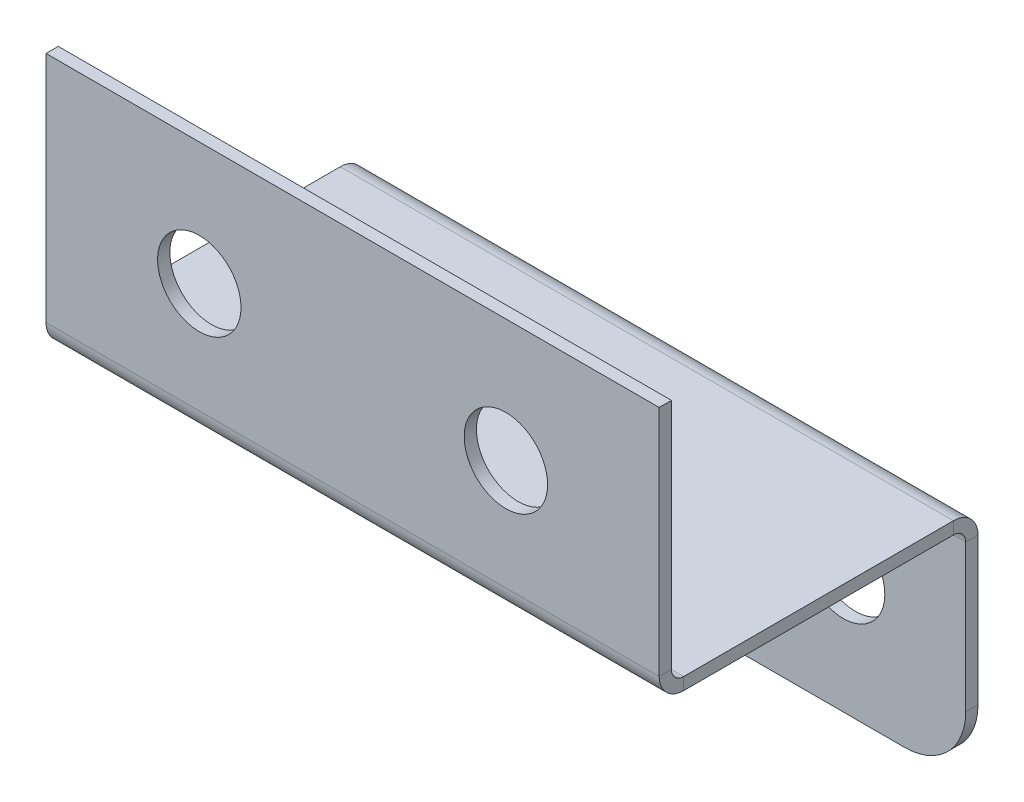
ISO-10303-21;
HEADER;
FILE_DESCRIPTION(('STEP AP214'),'2;1');
FILE_NAME('part.step','',(''),(''),'','','');
FILE_SCHEMA(('AUTOMOTIVE_DESIGN { 1 0 10303 214 1 1 1 1 }'));
ENDSEC;
DATA;
#1=APPLICATION_CONTEXT('core data for automotive mechanical design processes');
#2=APPLICATION_PROTOCOL_DEFINITION('international standard','automotive_design',2000,#1);
#3=PRODUCT_CONTEXT('',#1,'mechanical');
#4=PRODUCT('Part','Part','',(#3));
#5=PRODUCT_RELATED_PRODUCT_CATEGORY('part','',(#4));
#6=PRODUCT_DEFINITION_FORMATION('','',#4);
#7=PRODUCT_DEFINITION_CONTEXT('part definition',#1,'design');
#8=PRODUCT_DEFINITION('design','',#6,#7);
#9=PRODUCT_DEFINITION_SHAPE('','',#8);
#10=(LENGTH_UNIT() NAMED_UNIT(*) SI_UNIT(.MILLI.,.METRE.));
#11=(NAMED_UNIT(*) PLANE_ANGLE_UNIT() SI_UNIT($,.RADIAN.));
#12=(NAMED_UNIT(*) SI_UNIT($,.STERADIAN.) SOLID_ANGLE_UNIT());
#13=UNCERTAINTY_MEASURE_WITH_UNIT(LENGTH_MEASURE(1.E-05),#10,'distance_accuracy_value','');
#14=(GEOMETRIC_REPRESENTATION_CONTEXT(3) GLOBAL_UNCERTAINTY_ASSIGNED_CONTEXT((#13)) GLOBAL_UNIT_ASSIGNED_CONTEXT((#10,
#11,#12)) REPRESENTATION_CONTEXT('',''));
#15=CARTESIAN_POINT('',(0.,0.,0.));
#16=DIRECTION('',(0.,0.,1.));
#17=DIRECTION('',(1.,0.,0.));
#18=AXIS2_PLACEMENT_3D('',#15,#16,#17);
#19=CARTESIAN_POINT('',(25.,-20.,-1.));
#20=DIRECTION('',(1.,0.,0.));
#21=DIRECTION('',(0.,0.,-0.999999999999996));
#22=AXIS2_PLACEMENT_3D('',#19,#20,#21);
#23=PLANE('',#22);
#24=DIRECTION('',(0.,-1.,0.));
#25=VECTOR('',#24,1.);
#26=CARTESIAN_POINT('',(25.,-20.,-1.));
#27=LINE('',#26,#25);
#28=CARTESIAN_POINT('',(25.,-20.,-1.));
#29=VERTEX_POINT('',#28);
#30=CARTESIAN_POINT('',(25.,-21.,-1.));
#31=VERTEX_POINT('',#30);
#32=EDGE_CURVE('E325',#29,#31,#27,.T.);
#33=ORIENTED_EDGE('',*,*,#32,.F.);
#34=CARTESIAN_POINT('',(25.,-19.,-1.));
#35=DIRECTION('',(-1.,0.,0.));
#36=DIRECTION('',(0.,0.,0.999999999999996));
#37=AXIS2_PLACEMENT_3D('',#34,#35,#36);
#38=CIRCLE('',#37,1.);
#39=CARTESIAN_POINT('',(25.,-19.,0.));
#40=VERTEX_POINT('',#39);
#41=EDGE_CURVE('E245',#40,#29,#38,.F.);
#42=ORIENTED_EDGE('',*,*,#41,.F.);
#43=DIRECTION('',(0.,0.,-0.999999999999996));
#44=VECTOR('',#43,1.);
#45=CARTESIAN_POINT('',(25.,-18.9999999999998,1.));
#46=LINE('',#45,#44);
#47=CARTESIAN_POINT('',(25.,-18.9999999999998,1.));
#48=VERTEX_POINT('',#47);
#49=EDGE_CURVE('E322',#48,#40,#46,.T.);
#50=ORIENTED_EDGE('',*,*,#49,.F.);
#51=CARTESIAN_POINT('',(25.,-19.,-1.));
#52=DIRECTION('',(1.,0.,0.));
#53=DIRECTION('',(0.,0.,-0.999999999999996));
#54=AXIS2_PLACEMENT_3D('',#51,#52,#53);
#55=CIRCLE('',#54,2.);
#56=EDGE_CURVE('E261',#48,#31,#55,.T.);
#57=ORIENTED_EDGE('',*,*,#56,.T.);
#58=EDGE_LOOP('',(#33,#42,#50,#57));
#59=FACE_BOUND('',#58,.T.);
#60=ADVANCED_FACE('F56',(#59),#23,.T.);
#61=CARTESIAN_POINT('',(25.,-18.9999999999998,1.));
#62=DIRECTION('',(1.,0.,0.));
#63=DIRECTION('',(0.,0.,-0.999999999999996));
#64=AXIS2_PLACEMENT_3D('',#61,#62,#63);
#65=PLANE('',#64);
#66=DIRECTION('',(0.,0.,-0.999999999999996));
#67=VECTOR('',#66,1.);
#68=CARTESIAN_POINT('',(25.,-20.,0.));
#69=LINE('',#68,#67);
#70=CARTESIAN_POINT('',(25.,-19.9999999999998,-23.));
#71=VERTEX_POINT('',#70);
#72=EDGE_CURVE('E241',#29,#71,#69,.T.);
#73=ORIENTED_EDGE('',*,*,#72,.F.);
#74=ORIENTED_EDGE('',*,*,#32,.T.);
#75=DIRECTION('',(0.,0.,-0.999999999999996));
#76=VECTOR('',#75,1.);
#77=CARTESIAN_POINT('',(25.,-21.,0.));
#78=LINE('',#77,#76);
#79=CARTESIAN_POINT('',(25.,-20.9999999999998,-23.));
#80=VERTEX_POINT('',#79);
#81=EDGE_CURVE('E265',#31,#80,#78,.T.);
#82=ORIENTED_EDGE('',*,*,#81,.T.);
#83=DIRECTION('',(0.,1.,0.));
#84=VECTOR('',#83,1.);
#85=CARTESIAN_POINT('',(25.,-20.9999999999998,-23.));
#86=LINE('',#85,#84);
#87=EDGE_CURVE('E310',#80,#71,#86,.T.);
#88=ORIENTED_EDGE('',*,*,#87,.T.);
#89=EDGE_LOOP('',(#73,#74,#82,#88));
#90=FACE_BOUND('',#89,.T.);
#91=ADVANCED_FACE('F444',(#90),#65,.T.);
#92=CARTESIAN_POINT('',(-25.,-19.0000000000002,0.));
#93=DIRECTION('',(-1.,0.,0.));
#94=DIRECTION('',(0.,0.,0.999999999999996));
#95=AXIS2_PLACEMENT_3D('',#92,#93,#94);
#96=PLANE('',#95);
#97=DIRECTION('',(0.,0.,0.999999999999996));
#98=VECTOR('',#97,1.);
#99=CARTESIAN_POINT('',(-25.,-19.0000000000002,0.));
#100=LINE('',#99,#98);
#101=CARTESIAN_POINT('',(-25.,-19.0000000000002,0.));
#102=VERTEX_POINT('',#101);
#103=CARTESIAN_POINT('',(-25.,-19.,1.));
#104=VERTEX_POINT('',#103);
#105=EDGE_CURVE('E319',#102,#104,#100,.T.);
#106=ORIENTED_EDGE('',*,*,#105,.F.);
#107=CARTESIAN_POINT('',(-25.,-19.0000000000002,-1.));
#108=DIRECTION('',(-1.,0.,0.));
#109=DIRECTION('',(0.,0.,0.999999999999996));
#110=AXIS2_PLACEMENT_3D('',#107,#108,#109);
#111=CIRCLE('',#110,1.);
#112=CARTESIAN_POINT('',(-25.,-20.0000000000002,-1.));
#113=VERTEX_POINT('',#112);
#114=EDGE_CURVE('E204',#102,#113,#111,.F.);
#115=ORIENTED_EDGE('',*,*,#114,.T.);
#116=DIRECTION('',(0.,1.,0.));
#117=VECTOR('',#116,1.);
#118=CARTESIAN_POINT('',(-25.,-21.0000000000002,-1.));
#119=LINE('',#118,#117);
#120=CARTESIAN_POINT('',(-25.,-21.0000000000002,-1.));
#121=VERTEX_POINT('',#120);
#122=EDGE_CURVE('E316',#121,#113,#119,.T.);
#123=ORIENTED_EDGE('',*,*,#122,.F.);
#124=CARTESIAN_POINT('',(-25.,-19.0000000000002,-1.));
#125=DIRECTION('',(1.,0.,0.));
#126=DIRECTION('',(0.,0.,-0.999999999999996));
#127=AXIS2_PLACEMENT_3D('',#124,#125,#126);
#128=CIRCLE('',#127,2.);
#129=EDGE_CURVE('E223',#104,#121,#128,.T.);
#130=ORIENTED_EDGE('',*,*,#129,.F.);
#131=EDGE_LOOP('',(#106,#115,#123,#130));
#132=FACE_BOUND('',#131,.T.);
#133=ADVANCED_FACE('F402',(#132),#96,.T.);
#134=CARTESIAN_POINT('',(-25.,-21.0000000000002,-1.));
#135=DIRECTION('',(-1.,0.,0.));
#136=DIRECTION('',(0.,0.,0.999999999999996));
#137=AXIS2_PLACEMENT_3D('',#134,#135,#136);
#138=PLANE('',#137);
#139=DIRECTION('',(0.,-1.,0.));
#140=VECTOR('',#139,1.);
#141=CARTESIAN_POINT('',(-25.,0.,0.));
#142=LINE('',#141,#140);
#143=CARTESIAN_POINT('',(-25.,0.,0.));
#144=VERTEX_POINT('',#143);
#145=EDGE_CURVE('E211',#144,#102,#142,.T.);
#146=ORIENTED_EDGE('',*,*,#145,.T.);
#147=ORIENTED_EDGE('',*,*,#105,.T.);
#148=DIRECTION('',(0.,-1.,0.));
#149=VECTOR('',#148,1.);
#150=CARTESIAN_POINT('',(-25.,0.,1.));
#151=LINE('',#150,#149);
#152=CARTESIAN_POINT('',(-25.,0.,1.));
#153=VERTEX_POINT('',#152);
#154=EDGE_CURVE('E219',#153,#104,#151,.T.);
#155=ORIENTED_EDGE('',*,*,#154,.F.);
#156=DIRECTION('',(0.,0.,-0.999999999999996));
#157=VECTOR('',#156,1.);
#158=CARTESIAN_POINT('',(-25.,0.,1.));
#159=LINE('',#158,#157);
#160=EDGE_CURVE('E215',#153,#144,#159,.T.);
#161=ORIENTED_EDGE('',*,*,#160,.T.);
#162=EDGE_LOOP('',(#146,#147,#155,#161));
#163=FACE_BOUND('',#162,.T.);
#164=ADVANCED_FACE('F499',(#163),#138,.T.);
#165=CARTESIAN_POINT('',(25.,-22.,-25.));
#166=DIRECTION('',(1.,0.,0.));
#167=DIRECTION('',(0.,0.,-0.999999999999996));
#168=AXIS2_PLACEMENT_3D('',#165,#166,#167);
#169=PLANE('',#168);
#170=DIRECTION('',(0.,0.,0.999999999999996));
#171=VECTOR('',#170,1.);
#172=CARTESIAN_POINT('',(25.,-22.,-25.));
#173=LINE('',#172,#171);
#174=CARTESIAN_POINT('',(25.,-22.,-25.));
#175=VERTEX_POINT('',#174);
#176=CARTESIAN_POINT('',(25.,-22.,-24.));
#177=VERTEX_POINT('',#176);
#178=EDGE_CURVE('E313',#175,#177,#173,.T.);
#179=ORIENTED_EDGE('',*,*,#178,.F.);
#180=CARTESIAN_POINT('',(25.,-21.9999999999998,-23.));
#181=DIRECTION('',(1.,0.,0.));
#182=DIRECTION('',(0.,0.,-0.999999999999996));
#183=AXIS2_PLACEMENT_3D('',#180,#181,#182);
#184=CIRCLE('',#183,2.);
#185=EDGE_CURVE('E186',#71,#175,#184,.F.);
#186=ORIENTED_EDGE('',*,*,#185,.F.);
#187=ORIENTED_EDGE('',*,*,#87,.F.);
#188=CARTESIAN_POINT('',(25.,-21.9999999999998,-23.));
#189=DIRECTION('',(1.,0.,0.));
#190=DIRECTION('',(0.,0.,-0.999999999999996));
#191=AXIS2_PLACEMENT_3D('',#188,#189,#190);
#192=CIRCLE('',#191,1.);
#193=EDGE_CURVE('E269',#80,#177,#192,.F.);
#194=ORIENTED_EDGE('',*,*,#193,.T.);
#195=EDGE_LOOP('',(#179,#186,#187,#194));
#196=FACE_BOUND('',#195,.T.);
#197=ADVANCED_FACE('F417',(#196),#169,.T.);
#198=CARTESIAN_POINT('',(25.,-20.9999999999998,-23.));
#199=DIRECTION('',(1.,0.,0.));
#200=DIRECTION('',(0.,0.,-0.999999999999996));
#201=AXIS2_PLACEMENT_3D('',#198,#199,#200);
#202=PLANE('',#201);
#203=DIRECTION('',(0.,-1.,0.));
#204=VECTOR('',#203,1.);
#205=CARTESIAN_POINT('',(25.,-20.,-24.));
#206=LINE('',#205,#204);
#207=CARTESIAN_POINT('',(24.9999999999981,-34.,-24.));
#208=VERTEX_POINT('',#207);
#209=EDGE_CURVE('E234',#177,#208,#206,.T.);
#210=ORIENTED_EDGE('',*,*,#209,.T.);
#211=DIRECTION('',(0.,0.,0.999999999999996));
#212=VECTOR('',#211,1.);
#213=CARTESIAN_POINT('',(24.9999999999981,-34.,-23.));
#214=LINE('',#213,#212);
#215=CARTESIAN_POINT('',(24.9999999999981,-34.,-25.));
#216=VERTEX_POINT('',#215);
#217=EDGE_CURVE('E11',#208,#216,#214,.F.);
#218=ORIENTED_EDGE('',*,*,#217,.T.);
#219=DIRECTION('',(0.,-1.,0.));
#220=VECTOR('',#219,1.);
#221=CARTESIAN_POINT('',(25.,-20.,-25.));
#222=LINE('',#221,#220);
#223=EDGE_CURVE('E236',#175,#216,#222,.T.);
#224=ORIENTED_EDGE('',*,*,#223,.F.);
#225=ORIENTED_EDGE('',*,*,#178,.T.);
#226=EDGE_LOOP('',(#210,#218,#224,#225));
#227=FACE_BOUND('',#226,.T.);
#228=ADVANCED_FACE('F420',(#227),#202,.T.);
#229=CARTESIAN_POINT('',(-25.,-20.,-23.));
#230=DIRECTION('',(-1.,0.,0.));
#231=DIRECTION('',(0.,0.,0.999999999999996));
#232=AXIS2_PLACEMENT_3D('',#229,#230,#231);
#233=PLANE('',#232);
#234=DIRECTION('',(0.,-1.,0.));
#235=VECTOR('',#234,1.);
#236=CARTESIAN_POINT('',(-25.,-20.,-23.));
#237=LINE('',#236,#235);
#238=CARTESIAN_POINT('',(-25.,-20.,-23.));
#239=VERTEX_POINT('',#238);
#240=CARTESIAN_POINT('',(-25.,-21.,-23.));
#241=VERTEX_POINT('',#240);
#242=EDGE_CURVE('E173',#239,#241,#237,.T.);
#243=ORIENTED_EDGE('',*,*,#242,.F.);
#244=CARTESIAN_POINT('',(-25.,-22.,-23.));
#245=DIRECTION('',(1.,0.,0.));
#246=DIRECTION('',(0.,0.,-0.999999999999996));
#247=AXIS2_PLACEMENT_3D('',#244,#245,#246);
#248=CIRCLE('',#247,2.);
#249=CARTESIAN_POINT('',(-25.,-22.0000000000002,-25.));
#250=VERTEX_POINT('',#249);
#251=EDGE_CURVE('E183',#239,#250,#248,.F.);
#252=ORIENTED_EDGE('',*,*,#251,.T.);
#253=DIRECTION('',(0.,0.,-0.999999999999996));
#254=VECTOR('',#253,1.);
#255=CARTESIAN_POINT('',(-25.,-22.0000000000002,-24.));
#256=LINE('',#255,#254);
#257=CARTESIAN_POINT('',(-25.,-22.0000000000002,-24.));
#258=VERTEX_POINT('',#257);
#259=EDGE_CURVE('E159',#258,#250,#256,.T.);
#260=ORIENTED_EDGE('',*,*,#259,.F.);
#261=CARTESIAN_POINT('',(-25.,-22.,-23.));
#262=DIRECTION('',(1.,0.,0.));
#263=DIRECTION('',(0.,0.,-0.999999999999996));
#264=AXIS2_PLACEMENT_3D('',#261,#262,#263);
#265=CIRCLE('',#264,1.);
#266=EDGE_CURVE('E231',#241,#258,#265,.F.);
#267=ORIENTED_EDGE('',*,*,#266,.F.);
#268=EDGE_LOOP('',(#243,#252,#260,#267));
#269=FACE_BOUND('',#268,.T.);
#270=ADVANCED_FACE('F196',(#269),#233,.T.);
#271=CARTESIAN_POINT('',(-25.,-22.0000000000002,-24.));
#272=DIRECTION('',(-1.,0.,0.));
#273=DIRECTION('',(0.,0.,0.999999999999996));
#274=AXIS2_PLACEMENT_3D('',#271,#272,#273);
#275=PLANE('',#274);
#276=DIRECTION('',(0.,0.,-0.999999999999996));
#277=VECTOR('',#276,1.);
#278=CARTESIAN_POINT('',(-25.,-20.0000000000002,0.));
#279=LINE('',#278,#277);
#280=EDGE_CURVE('E199',#113,#239,#279,.T.);
#281=ORIENTED_EDGE('',*,*,#280,.T.);
#282=ORIENTED_EDGE('',*,*,#242,.T.);
#283=DIRECTION('',(0.,0.,-0.999999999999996));
#284=VECTOR('',#283,1.);
#285=CARTESIAN_POINT('',(-25.,-21.0000000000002,0.));
#286=LINE('',#285,#284);
#287=EDGE_CURVE('E227',#121,#241,#286,.T.);
#288=ORIENTED_EDGE('',*,*,#287,.F.);
#289=ORIENTED_EDGE('',*,*,#122,.T.);
#290=EDGE_LOOP('',(#281,#282,#288,#289));
#291=FACE_BOUND('',#290,.T.);
#292=ADVANCED_FACE('F406',(#291),#275,.T.);
#293=CARTESIAN_POINT('',(25.,-20.,-24.));
#294=DIRECTION('',(0.,0.,-0.999999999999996));
#295=DIRECTION('',(0.,1.,0.));
#296=AXIS2_PLACEMENT_3D('',#293,#294,#295);
#297=PLANE('',#296);
#298=CARTESIAN_POINT('',(-15.,-29.,-24.));
#299=DIRECTION('',(0.,0.,0.999999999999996));
#300=DIRECTION('',(1.,0.,0.));
#301=AXIS2_PLACEMENT_3D('',#298,#299,#300);
#302=CIRCLE('',#301,3.4);
#303=CARTESIAN_POINT('',(-11.6,-29.,-24.));
#304=VERTEX_POINT('',#303);
#305=EDGE_CURVE('E352',#304,#304,#302,.T.);
#306=ORIENTED_EDGE('',*,*,#305,.F.);
#307=EDGE_LOOP('',(#306));
#308=FACE_BOUND('',#307,.T.);
#309=CARTESIAN_POINT('',(15.,-29.,-24.));
#310=DIRECTION('',(0.,0.,0.999999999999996));
#311=DIRECTION('',(1.,0.,0.));
#312=AXIS2_PLACEMENT_3D('',#309,#310,#311);
#313=CIRCLE('',#312,3.4);
#314=CARTESIAN_POINT('',(18.4,-29.,-24.));
#315=VERTEX_POINT('',#314);
#316=EDGE_CURVE('E351',#315,#315,#313,.T.);
#317=ORIENTED_EDGE('',*,*,#316,.F.);
#318=EDGE_LOOP('',(#317));
#319=FACE_BOUND('',#318,.T.);
#320=DIRECTION('',(0.,-1.,0.));
#321=VECTOR('',#320,1.);
#322=CARTESIAN_POINT('',(-25.,-20.0000000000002,-24.));
#323=LINE('',#322,#321);
#324=CARTESIAN_POINT('',(-25.0000000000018,-34.0000000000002,-24.));
#325=VERTEX_POINT('',#324);
#326=EDGE_CURVE('E167',#258,#325,#323,.T.);
#327=ORIENTED_EDGE('',*,*,#326,.T.);
#328=CARTESIAN_POINT('',(-20.0000000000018,-34.,-24.));
#329=DIRECTION('',(0.,0.,-0.999999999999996));
#330=DIRECTION('',(0.,1.,0.));
#331=AXIS2_PLACEMENT_3D('',#328,#329,#330);
#332=CIRCLE('',#331,5.);
#333=CARTESIAN_POINT('',(-20.,-39.,-24.));
#334=VERTEX_POINT('',#333);
#335=EDGE_CURVE('E334',#325,#334,#332,.F.);
#336=ORIENTED_EDGE('',*,*,#335,.T.);
#337=DIRECTION('',(-1.,0.,0.));
#338=VECTOR('',#337,1.);
#339=CARTESIAN_POINT('',(24.9999999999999,-39.,-24.));
#340=LINE('',#339,#338);
#341=CARTESIAN_POINT('',(20.,-39.0000000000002,-24.));
#342=VERTEX_POINT('',#341);
#343=EDGE_CURVE('E174',#342,#334,#340,.T.);
#344=ORIENTED_EDGE('',*,*,#343,.F.);
#345=CARTESIAN_POINT('',(19.9999999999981,-34.0000000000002,-24.));
#346=DIRECTION('',(0.,0.,-0.999999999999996));
#347=DIRECTION('',(0.,1.,0.));
#348=AXIS2_PLACEMENT_3D('',#345,#346,#347);
#349=CIRCLE('',#348,5.);
#350=EDGE_CURVE('E331',#342,#208,#349,.F.);
#351=ORIENTED_EDGE('',*,*,#350,.T.);
#352=ORIENTED_EDGE('',*,*,#209,.F.);
#353=DIRECTION('',(-1.,0.,0.));
#354=VECTOR('',#353,1.);
#355=CARTESIAN_POINT('',(25.,-22.,-24.));
#356=LINE('',#355,#354);
#357=EDGE_CURVE('E273',#177,#258,#356,.T.);
#358=ORIENTED_EDGE('',*,*,#357,.T.);
#359=EDGE_LOOP('',(#327,#336,#344,#351,#352,#358));
#360=FACE_BOUND('',#359,.T.);
#361=ADVANCED_FACE('F429',(#308,#319,#360),#297,.F.);
#362=CARTESIAN_POINT('',(24.9999999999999,-39.,-25.));
#363=DIRECTION('',(0.,-1.,0.));
#364=DIRECTION('',(0.,0.,-0.999999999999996));
#365=AXIS2_PLACEMENT_3D('',#362,#363,#364);
#366=PLANE('',#365);
#367=ORIENTED_EDGE('',*,*,#343,.T.);
#368=DIRECTION('',(0.,0.,0.999999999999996));
#369=VECTOR('',#368,1.);
#370=CARTESIAN_POINT('',(-20.,-39.,-25.));
#371=LINE('',#370,#369);
#372=CARTESIAN_POINT('',(-20.,-39.,-25.));
#373=VERTEX_POINT('',#372);
#374=EDGE_CURVE('E77',#334,#373,#371,.F.);
#375=ORIENTED_EDGE('',*,*,#374,.T.);
#376=DIRECTION('',(-1.,0.,0.));
#377=VECTOR('',#376,1.);
#378=CARTESIAN_POINT('',(24.9999999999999,-39.,-25.));
#379=LINE('',#378,#377);
#380=CARTESIAN_POINT('',(20.,-39.0000000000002,-25.));
#381=VERTEX_POINT('',#380);
#382=EDGE_CURVE('E189',#381,#373,#379,.T.);
#383=ORIENTED_EDGE('',*,*,#382,.F.);
#384=DIRECTION('',(0.,0.,0.999999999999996));
#385=VECTOR('',#384,1.);
#386=CARTESIAN_POINT('',(20.,-39.0000000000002,-25.));
#387=LINE('',#386,#385);
#388=EDGE_CURVE('E337',#381,#342,#387,.T.);
#389=ORIENTED_EDGE('',*,*,#388,.T.);
#390=EDGE_LOOP('',(#367,#375,#383,#389));
#391=FACE_BOUND('',#390,.T.);
#392=ADVANCED_FACE('F427',(#391),#366,.T.);
#393=CARTESIAN_POINT('',(25.,-20.,-25.));
#394=DIRECTION('',(0.,0.,-0.999999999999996));
#395=DIRECTION('',(0.,1.,0.));
#396=AXIS2_PLACEMENT_3D('',#393,#394,#395);
#397=PLANE('',#396);
#398=CARTESIAN_POINT('',(-15.,-29.,-25.));
#399=DIRECTION('',(0.,0.,-0.999999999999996));
#400=DIRECTION('',(0.,1.,0.));
#401=AXIS2_PLACEMENT_3D('',#398,#399,#400);
#402=CIRCLE('',#401,3.4);
#403=CARTESIAN_POINT('',(-11.6,-29.,-25.));
#404=VERTEX_POINT('',#403);
#405=EDGE_CURVE('E365',#404,#404,#402,.F.);
#406=ORIENTED_EDGE('',*,*,#405,.T.);
#407=EDGE_LOOP('',(#406));
#408=FACE_BOUND('',#407,.T.);
#409=CARTESIAN_POINT('',(15.,-29.,-25.));
#410=DIRECTION('',(0.,0.,-0.999999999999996));
#411=DIRECTION('',(0.,1.,0.));
#412=AXIS2_PLACEMENT_3D('',#409,#410,#411);
#413=CIRCLE('',#412,3.4);
#414=CARTESIAN_POINT('',(18.4,-29.,-25.));
#415=VERTEX_POINT('',#414);
#416=EDGE_CURVE('E349',#415,#415,#413,.F.);
#417=ORIENTED_EDGE('',*,*,#416,.T.);
#418=EDGE_LOOP('',(#417));
#419=FACE_BOUND('',#418,.T.);
#420=ORIENTED_EDGE('',*,*,#382,.T.);
#421=CARTESIAN_POINT('',(-20.0000000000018,-34.,-25.));
#422=DIRECTION('',(0.,0.,-0.999999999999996));
#423=DIRECTION('',(0.,1.,0.));
#424=AXIS2_PLACEMENT_3D('',#421,#422,#423);
#425=CIRCLE('',#424,5.);
#426=CARTESIAN_POINT('',(-25.0000000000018,-34.0000000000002,-25.));
#427=VERTEX_POINT('',#426);
#428=EDGE_CURVE('E64',#373,#427,#425,.T.);
#429=ORIENTED_EDGE('',*,*,#428,.T.);
#430=DIRECTION('',(0.,-1.,0.));
#431=VECTOR('',#430,1.);
#432=CARTESIAN_POINT('',(-25.,-20.0000000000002,-25.));
#433=LINE('',#432,#431);
#434=EDGE_CURVE('E164',#250,#427,#433,.T.);
#435=ORIENTED_EDGE('',*,*,#434,.F.);
#436=DIRECTION('',(-1.,0.,0.));
#437=VECTOR('',#436,1.);
#438=CARTESIAN_POINT('',(25.,-22.,-25.));
#439=LINE('',#438,#437);
#440=EDGE_CURVE('E180',#175,#250,#439,.T.);
#441=ORIENTED_EDGE('',*,*,#440,.F.);
#442=ORIENTED_EDGE('',*,*,#223,.T.);
#443=CARTESIAN_POINT('',(19.9999999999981,-34.0000000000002,-25.));
#444=DIRECTION('',(0.,0.,-0.999999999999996));
#445=DIRECTION('',(0.,1.,0.));
#446=AXIS2_PLACEMENT_3D('',#443,#444,#445);
#447=CIRCLE('',#446,5.);
#448=EDGE_CURVE('E343',#216,#381,#447,.T.);
#449=ORIENTED_EDGE('',*,*,#448,.T.);
#450=EDGE_LOOP('',(#420,#429,#435,#441,#442,#449));
#451=FACE_BOUND('',#450,.T.);
#452=ADVANCED_FACE('F192',(#408,#419,#451),#397,.T.);
#453=CARTESIAN_POINT('',(25.,-21.9999999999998,-23.));
#454=DIRECTION('',(-1.,0.,0.));
#455=DIRECTION('',(0.,0.,0.999999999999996));
#456=AXIS2_PLACEMENT_3D('',#453,#454,#455);
#457=CYLINDRICAL_SURFACE('',#456,2.);
#458=ORIENTED_EDGE('',*,*,#251,.F.);
#459=DIRECTION('',(-1.,0.,0.));
#460=VECTOR('',#459,1.);
#461=CARTESIAN_POINT('',(25.,-19.9999999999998,-23.));
#462=LINE('',#461,#460);
#463=EDGE_CURVE('E190',#71,#239,#462,.T.);
#464=ORIENTED_EDGE('',*,*,#463,.F.);
#465=ORIENTED_EDGE('',*,*,#185,.T.);
#466=ORIENTED_EDGE('',*,*,#440,.T.);
#467=EDGE_LOOP('',(#458,#464,#465,#466));
#468=FACE_BOUND('',#467,.T.);
#469=ADVANCED_FACE('F181',(#468),#457,.T.);
#470=CARTESIAN_POINT('',(25.,-20.,0.));
#471=DIRECTION('',(0.,1.,0.));
#472=DIRECTION('',(0.,0.,0.999999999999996));
#473=AXIS2_PLACEMENT_3D('',#470,#471,#472);
#474=PLANE('',#473);
#475=ORIENTED_EDGE('',*,*,#280,.F.);
#476=DIRECTION('',(-1.,0.,0.));
#477=VECTOR('',#476,1.);
#478=CARTESIAN_POINT('',(25.,-20.,-1.));
#479=LINE('',#478,#477);
#480=EDGE_CURVE('E299',#29,#113,#479,.T.);
#481=ORIENTED_EDGE('',*,*,#480,.F.);
#482=ORIENTED_EDGE('',*,*,#72,.T.);
#483=ORIENTED_EDGE('',*,*,#463,.T.);
#484=EDGE_LOOP('',(#475,#481,#482,#483));
#485=FACE_BOUND('',#484,.T.);
#486=ADVANCED_FACE('F415',(#485),#474,.T.);
#487=CARTESIAN_POINT('',(25.,-19.,-1.));
#488=DIRECTION('',(-1.,0.,0.));
#489=DIRECTION('',(0.,0.,0.999999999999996));
#490=AXIS2_PLACEMENT_3D('',#487,#488,#489);
#491=CYLINDRICAL_SURFACE('',#490,1.);
#492=ORIENTED_EDGE('',*,*,#114,.F.);
#493=DIRECTION('',(-1.,0.,0.));
#494=VECTOR('',#493,1.);
#495=CARTESIAN_POINT('',(25.,-19.,0.));
#496=LINE('',#495,#494);
#497=EDGE_CURVE('E295',#40,#102,#496,.T.);
#498=ORIENTED_EDGE('',*,*,#497,.F.);
#499=ORIENTED_EDGE('',*,*,#41,.T.);
#500=ORIENTED_EDGE('',*,*,#480,.T.);
#501=EDGE_LOOP('',(#492,#498,#499,#500));
#502=FACE_BOUND('',#501,.T.);
#503=ADVANCED_FACE('F410',(#502),#491,.F.);
#504=CARTESIAN_POINT('',(25.,0.,0.));
#505=DIRECTION('',(0.,0.,-0.999999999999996));
#506=DIRECTION('',(0.,1.,0.));
#507=AXIS2_PLACEMENT_3D('',#504,#505,#506);
#508=PLANE('',#507);
#509=CARTESIAN_POINT('',(-12.5000000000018,-10.,0.));
#510=DIRECTION('',(0.,0.,-0.999999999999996));
#511=DIRECTION('',(0.,1.,0.));
#512=AXIS2_PLACEMENT_3D('',#509,#510,#511);
#513=CIRCLE('',#512,3.4);
#514=CARTESIAN_POINT('',(-9.10000000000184,-10.0000000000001,0.));
#515=VERTEX_POINT('',#514);
#516=EDGE_CURVE('E359',#515,#515,#513,.F.);
#517=ORIENTED_EDGE('',*,*,#516,.T.);
#518=EDGE_LOOP('',(#517));
#519=FACE_BOUND('',#518,.T.);
#520=CARTESIAN_POINT('',(12.4999999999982,-9.99999999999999,0.));
#521=DIRECTION('',(0.,0.,-0.999999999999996));
#522=DIRECTION('',(0.,1.,0.));
#523=AXIS2_PLACEMENT_3D('',#520,#521,#522);
#524=CIRCLE('',#523,3.4);
#525=CARTESIAN_POINT('',(15.8999999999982,-10.,0.));
#526=VERTEX_POINT('',#525);
#527=EDGE_CURVE('E358',#526,#526,#524,.F.);
#528=ORIENTED_EDGE('',*,*,#527,.T.);
#529=EDGE_LOOP('',(#528));
#530=FACE_BOUND('',#529,.T.);
#531=ORIENTED_EDGE('',*,*,#145,.F.);
#532=DIRECTION('',(-1.,0.,0.));
#533=VECTOR('',#532,1.);
#534=CARTESIAN_POINT('',(25.,0.,0.));
#535=LINE('',#534,#533);
#536=CARTESIAN_POINT('',(25.,0.,0.));
#537=VERTEX_POINT('',#536);
#538=EDGE_CURVE('E292',#537,#144,#535,.T.);
#539=ORIENTED_EDGE('',*,*,#538,.F.);
#540=DIRECTION('',(0.,-1.,0.));
#541=VECTOR('',#540,1.);
#542=CARTESIAN_POINT('',(25.,0.,0.));
#543=LINE('',#542,#541);
#544=EDGE_CURVE('E249',#537,#40,#543,.T.);
#545=ORIENTED_EDGE('',*,*,#544,.T.);
#546=ORIENTED_EDGE('',*,*,#497,.T.);
#547=EDGE_LOOP('',(#531,#539,#545,#546));
#548=FACE_BOUND('',#547,.T.);
#549=ADVANCED_FACE('F472',(#519,#530,#548),#508,.T.);
#550=CARTESIAN_POINT('',(25.,-1.17961196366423E-13,1.));
#551=DIRECTION('',(0.,1.,0.));
#552=DIRECTION('',(0.,0.,0.999999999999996));
#553=AXIS2_PLACEMENT_3D('',#550,#551,#552);
#554=PLANE('',#553);
#555=ORIENTED_EDGE('',*,*,#160,.F.);
#556=DIRECTION('',(-1.,0.,0.));
#557=VECTOR('',#556,1.);
#558=CARTESIAN_POINT('',(25.,-1.17961196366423E-13,1.));
#559=LINE('',#558,#557);
#560=CARTESIAN_POINT('',(25.,-1.17961196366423E-13,1.));
#561=VERTEX_POINT('',#560);
#562=EDGE_CURVE('E289',#561,#153,#559,.T.);
#563=ORIENTED_EDGE('',*,*,#562,.F.);
#564=DIRECTION('',(0.,0.,-0.999999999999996));
#565=VECTOR('',#564,1.);
#566=CARTESIAN_POINT('',(25.,-1.17961196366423E-13,1.));
#567=LINE('',#566,#565);
#568=EDGE_CURVE('E253',#561,#537,#567,.T.);
#569=ORIENTED_EDGE('',*,*,#568,.T.);
#570=ORIENTED_EDGE('',*,*,#538,.T.);
#571=EDGE_LOOP('',(#555,#563,#569,#570));
#572=FACE_BOUND('',#571,.T.);
#573=ADVANCED_FACE('F389',(#572),#554,.T.);
#574=CARTESIAN_POINT('',(25.,-1.17961196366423E-13,1.));
#575=DIRECTION('',(0.,0.,-0.999999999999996));
#576=DIRECTION('',(0.,1.,0.));
#577=AXIS2_PLACEMENT_3D('',#574,#575,#576);
#578=PLANE('',#577);
#579=CARTESIAN_POINT('',(-12.5000000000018,-10.0000000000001,1.));
#580=DIRECTION('',(0.,0.,0.999999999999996));
#581=DIRECTION('',(1.,0.,0.));
#582=AXIS2_PLACEMENT_3D('',#579,#580,#581);
#583=CIRCLE('',#582,3.4);
#584=CARTESIAN_POINT('',(-9.10000000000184,-10.0000000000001,1.));
#585=VERTEX_POINT('',#584);
#586=EDGE_CURVE('E355',#585,#585,#583,.T.);
#587=ORIENTED_EDGE('',*,*,#586,.F.);
#588=EDGE_LOOP('',(#587));
#589=FACE_BOUND('',#588,.T.);
#590=CARTESIAN_POINT('',(12.4999999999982,-10.,1.));
#591=DIRECTION('',(0.,0.,0.999999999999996));
#592=DIRECTION('',(1.,0.,0.));
#593=AXIS2_PLACEMENT_3D('',#590,#591,#592);
#594=CIRCLE('',#593,3.4);
#595=CARTESIAN_POINT('',(15.8999999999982,-10.,1.));
#596=VERTEX_POINT('',#595);
#597=EDGE_CURVE('E347',#596,#596,#594,.T.);
#598=ORIENTED_EDGE('',*,*,#597,.F.);
#599=EDGE_LOOP('',(#598));
#600=FACE_BOUND('',#599,.T.);
#601=ORIENTED_EDGE('',*,*,#154,.T.);
#602=DIRECTION('',(-1.,0.,0.));
#603=VECTOR('',#602,1.);
#604=CARTESIAN_POINT('',(25.,-18.9999999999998,1.));
#605=LINE('',#604,#603);
#606=EDGE_CURVE('E285',#48,#104,#605,.T.);
#607=ORIENTED_EDGE('',*,*,#606,.F.);
#608=DIRECTION('',(0.,-1.,0.));
#609=VECTOR('',#608,1.);
#610=CARTESIAN_POINT('',(25.,-1.17961196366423E-13,1.));
#611=LINE('',#610,#609);
#612=EDGE_CURVE('E257',#561,#48,#611,.T.);
#613=ORIENTED_EDGE('',*,*,#612,.F.);
#614=ORIENTED_EDGE('',*,*,#562,.T.);
#615=EDGE_LOOP('',(#601,#607,#613,#614));
#616=FACE_BOUND('',#615,.T.);
#617=ADVANCED_FACE('F385',(#589,#600,#616),#578,.F.);
#618=CARTESIAN_POINT('',(25.,-19.,-1.));
#619=DIRECTION('',(-1.,0.,0.));
#620=DIRECTION('',(0.,0.,0.999999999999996));
#621=AXIS2_PLACEMENT_3D('',#618,#619,#620);
#622=CYLINDRICAL_SURFACE('',#621,2.);
#623=ORIENTED_EDGE('',*,*,#129,.T.);
#624=DIRECTION('',(-1.,0.,0.));
#625=VECTOR('',#624,1.);
#626=CARTESIAN_POINT('',(25.,-21.,-1.));
#627=LINE('',#626,#625);
#628=EDGE_CURVE('E281',#31,#121,#627,.T.);
#629=ORIENTED_EDGE('',*,*,#628,.F.);
#630=ORIENTED_EDGE('',*,*,#56,.F.);
#631=ORIENTED_EDGE('',*,*,#606,.T.);
#632=EDGE_LOOP('',(#623,#629,#630,#631));
#633=FACE_BOUND('',#632,.T.);
#634=ADVANCED_FACE('F388',(#633),#622,.T.);
#635=CARTESIAN_POINT('',(25.,-21.,0.));
#636=DIRECTION('',(0.,1.,0.));
#637=DIRECTION('',(0.,0.,0.999999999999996));
#638=AXIS2_PLACEMENT_3D('',#635,#636,#637);
#639=PLANE('',#638);
#640=ORIENTED_EDGE('',*,*,#287,.T.);
#641=DIRECTION('',(-1.,0.,0.));
#642=VECTOR('',#641,1.);
#643=CARTESIAN_POINT('',(25.,-20.9999999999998,-23.));
#644=LINE('',#643,#642);
#645=EDGE_CURVE('E277',#80,#241,#644,.T.);
#646=ORIENTED_EDGE('',*,*,#645,.F.);
#647=ORIENTED_EDGE('',*,*,#81,.F.);
#648=ORIENTED_EDGE('',*,*,#628,.T.);
#649=EDGE_LOOP('',(#640,#646,#647,#648));
#650=FACE_BOUND('',#649,.T.);
#651=ADVANCED_FACE('F453',(#650),#639,.F.);
#652=CARTESIAN_POINT('',(25.,-21.9999999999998,-23.));
#653=DIRECTION('',(-1.,0.,0.));
#654=DIRECTION('',(0.,0.,0.999999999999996));
#655=AXIS2_PLACEMENT_3D('',#652,#653,#654);
#656=CYLINDRICAL_SURFACE('',#655,1.);
#657=ORIENTED_EDGE('',*,*,#266,.T.);
#658=ORIENTED_EDGE('',*,*,#357,.F.);
#659=ORIENTED_EDGE('',*,*,#193,.F.);
#660=ORIENTED_EDGE('',*,*,#645,.T.);
#661=EDGE_LOOP('',(#657,#658,#659,#660));
#662=FACE_BOUND('',#661,.T.);
#663=ADVANCED_FACE('F455',(#662),#656,.F.);
#664=CARTESIAN_POINT('',(25.,-21.9999999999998,-23.));
#665=DIRECTION('',(1.,0.,0.));
#666=DIRECTION('',(0.,0.,-0.999999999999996));
#667=AXIS2_PLACEMENT_3D('',#664,#665,#666);
#668=PLANE('',#667);
#669=ORIENTED_EDGE('',*,*,#612,.T.);
#670=ORIENTED_EDGE('',*,*,#49,.T.);
#671=ORIENTED_EDGE('',*,*,#544,.F.);
#672=ORIENTED_EDGE('',*,*,#568,.F.);
#673=EDGE_LOOP('',(#669,#670,#671,#672));
#674=FACE_BOUND('',#673,.T.);
#675=ADVANCED_FACE('F457',(#674),#668,.T.);
#676=CARTESIAN_POINT('',(-25.,-22.,-23.));
#677=DIRECTION('',(1.,0.,0.));
#678=DIRECTION('',(0.,0.,-0.999999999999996));
#679=AXIS2_PLACEMENT_3D('',#676,#677,#678);
#680=PLANE('',#679);
#681=ORIENTED_EDGE('',*,*,#434,.T.);
#682=DIRECTION('',(0.,0.,0.999999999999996));
#683=VECTOR('',#682,1.);
#684=CARTESIAN_POINT('',(-25.0000000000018,-34.0000000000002,-24.));
#685=LINE('',#684,#683);
#686=EDGE_CURVE('E328',#427,#325,#685,.T.);
#687=ORIENTED_EDGE('',*,*,#686,.T.);
#688=ORIENTED_EDGE('',*,*,#326,.F.);
#689=ORIENTED_EDGE('',*,*,#259,.T.);
#690=EDGE_LOOP('',(#681,#687,#688,#689));
#691=FACE_BOUND('',#690,.T.);
#692=ADVANCED_FACE('F161',(#691),#680,.F.);
#693=CARTESIAN_POINT('',(12.4999999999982,-10.,-25.001));
#694=DIRECTION('',(0.,0.,0.999999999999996));
#695=DIRECTION('',(1.,0.,0.));
#696=AXIS2_PLACEMENT_3D('',#693,#694,#695);
#697=CYLINDRICAL_SURFACE('',#696,3.4);
#698=CARTESIAN_POINT('',(15.8999999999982,-10.,0.));
#699=CARTESIAN_POINT('',(15.8999999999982,-10.,0.0104166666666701));
#700=CARTESIAN_POINT('',(15.8999999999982,-10.,0.0208333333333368));
#701=CARTESIAN_POINT('',(15.8999999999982,-10.,0.0416666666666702));
#702=CARTESIAN_POINT('',(15.8999999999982,-10.,0.0520833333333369));
#703=CARTESIAN_POINT('',(15.8999999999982,-10.,0.0729166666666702));
#704=CARTESIAN_POINT('',(15.8999999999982,-10.,0.0833333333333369));
#705=CARTESIAN_POINT('',(15.8999999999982,-10.,0.10416666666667));
#706=CARTESIAN_POINT('',(15.8999999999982,-10.,0.114583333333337));
#707=CARTESIAN_POINT('',(15.8999999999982,-10.,0.13541666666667));
#708=CARTESIAN_POINT('',(15.8999999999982,-10.,0.145833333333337));
#709=CARTESIAN_POINT('',(15.8999999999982,-10.,0.16666666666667));
#710=CARTESIAN_POINT('',(15.8999999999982,-10.,0.177083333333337));
#711=CARTESIAN_POINT('',(15.8999999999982,-10.,0.19791666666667));
#712=CARTESIAN_POINT('',(15.8999999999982,-10.,0.208333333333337));
#713=CARTESIAN_POINT('',(15.8999999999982,-10.,0.22916666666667));
#714=CARTESIAN_POINT('',(15.8999999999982,-10.,0.239583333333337));
#715=CARTESIAN_POINT('',(15.8999999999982,-10.,0.260416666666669));
#716=CARTESIAN_POINT('',(15.8999999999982,-10.,0.270833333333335));
#717=CARTESIAN_POINT('',(15.8999999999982,-10.,0.291666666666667));
#718=CARTESIAN_POINT('',(15.8999999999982,-10.,0.302083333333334));
#719=CARTESIAN_POINT('',(15.8999999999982,-10.,0.322916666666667));
#720=CARTESIAN_POINT('',(15.8999999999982,-10.,0.333333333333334));
#721=CARTESIAN_POINT('',(15.8999999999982,-10.,0.354166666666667));
#722=CARTESIAN_POINT('',(15.8999999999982,-10.,0.364583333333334));
#723=CARTESIAN_POINT('',(15.8999999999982,-10.,0.385416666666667));
#724=CARTESIAN_POINT('',(15.8999999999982,-10.,0.395833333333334));
#725=CARTESIAN_POINT('',(15.8999999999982,-10.,0.416666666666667));
#726=CARTESIAN_POINT('',(15.8999999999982,-10.,0.427083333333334));
#727=CARTESIAN_POINT('',(15.8999999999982,-10.,0.447916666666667));
#728=CARTESIAN_POINT('',(15.8999999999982,-10.,0.458333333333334));
#729=CARTESIAN_POINT('',(15.8999999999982,-10.,0.479166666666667));
#730=CARTESIAN_POINT('',(15.8999999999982,-10.,0.489583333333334));
#731=CARTESIAN_POINT('',(15.8999999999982,-10.,0.510416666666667));
#732=CARTESIAN_POINT('',(15.8999999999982,-10.,0.520833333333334));
#733=CARTESIAN_POINT('',(15.8999999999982,-10.,0.541666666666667));
#734=CARTESIAN_POINT('',(15.8999999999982,-10.,0.552083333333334));
#735=CARTESIAN_POINT('',(15.8999999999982,-10.,0.572916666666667));
#736=CARTESIAN_POINT('',(15.8999999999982,-10.,0.583333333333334));
#737=CARTESIAN_POINT('',(15.8999999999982,-10.,0.604166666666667));
#738=CARTESIAN_POINT('',(15.8999999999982,-10.,0.614583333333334));
#739=CARTESIAN_POINT('',(15.8999999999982,-10.,0.635416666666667));
#740=CARTESIAN_POINT('',(15.8999999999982,-10.,0.645833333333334));
#741=CARTESIAN_POINT('',(15.8999999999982,-10.,0.666666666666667));
#742=CARTESIAN_POINT('',(15.8999999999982,-10.,0.677083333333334));
#743=CARTESIAN_POINT('',(15.8999999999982,-10.,0.697916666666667));
#744=CARTESIAN_POINT('',(15.8999999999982,-10.,0.708333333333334));
#745=CARTESIAN_POINT('',(15.8999999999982,-10.,0.729166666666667));
#746=CARTESIAN_POINT('',(15.8999999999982,-10.,0.739583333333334));
#747=CARTESIAN_POINT('',(15.8999999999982,-10.,0.760416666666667));
#748=CARTESIAN_POINT('',(15.8999999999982,-10.,0.770833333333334));
#749=CARTESIAN_POINT('',(15.8999999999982,-10.,0.791666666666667));
#750=CARTESIAN_POINT('',(15.8999999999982,-10.,0.802083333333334));
#751=CARTESIAN_POINT('',(15.8999999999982,-10.,0.822916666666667));
#752=CARTESIAN_POINT('',(15.8999999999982,-10.,0.833333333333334));
#753=CARTESIAN_POINT('',(15.8999999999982,-10.,0.854166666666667));
#754=CARTESIAN_POINT('',(15.8999999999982,-10.,0.864583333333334));
#755=CARTESIAN_POINT('',(15.8999999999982,-10.,0.885416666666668));
#756=CARTESIAN_POINT('',(15.8999999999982,-10.,0.895833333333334));
#757=CARTESIAN_POINT('',(15.8999999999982,-10.,0.916666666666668));
#758=CARTESIAN_POINT('',(15.8999999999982,-10.,0.927083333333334));
#759=CARTESIAN_POINT('',(15.8999999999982,-10.,0.947916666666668));
#760=CARTESIAN_POINT('',(15.8999999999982,-10.,0.958333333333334));
#761=CARTESIAN_POINT('',(15.8999999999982,-10.,0.979166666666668));
#762=CARTESIAN_POINT('',(15.8999999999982,-10.,0.989583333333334));
#763=CARTESIAN_POINT('',(15.8999999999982,-10.,1.));
#764=B_SPLINE_CURVE_WITH_KNOTS('',3,(#698,#699,#700,#701,#702,#703,#704,#705,#706,#707,#708,
#709,#710,#711,#712,#713,#714,#715,#716,#717,#718,#719,#720,#721,#722,#723,#724,#725,#726,#727,
#728,#729,#730,#731,#732,#733,#734,#735,#736,#737,#738,#739,#740,#741,#742,#743,#744,#745,#746,
#747,#748,#749,#750,#751,#752,#753,#754,#755,#756,#757,#758,#759,#760,#761,#762,#763),
.UNSPECIFIED.,.F.,.F.,(4,2,2,2,2,2,2,2,2,2,2,2,2,2,2,2,2,2,2,2,2,2,2,2,2,2,2,2,2,2,2,2,4),(0.,
0.03125,0.0625000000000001,0.0937500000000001,0.125,0.15625,0.1875,0.21875,0.25,
0.281249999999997,0.312499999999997,0.343749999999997,0.374999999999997,0.406249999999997,
0.437499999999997,0.468749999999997,0.499999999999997,0.531249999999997,0.562499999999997,
0.593749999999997,0.624999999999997,0.656249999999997,0.687499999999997,0.718749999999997,
0.749999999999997,0.781249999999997,0.812499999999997,0.843749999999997,0.874999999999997,
0.906249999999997,0.937499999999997,0.968749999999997,0.999999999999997),.UNSPECIFIED.);
#765=EDGE_CURVE('BSEAM383',#526,#596,#764,.T.);
#766=ORIENTED_EDGE('',*,*,#527,.F.);
#767=ORIENTED_EDGE('',*,*,#597,.T.);
#768=ORIENTED_EDGE('',*,*,#765,.T.);
#769=ORIENTED_EDGE('',*,*,#765,.F.);
#770=EDGE_LOOP('',(#766,#768,#767,#769));
#771=FACE_BOUND('',#770,.T.);
#772=ADVANCED_FACE('F383',(#771),#697,.F.);
#773=CARTESIAN_POINT('',(-12.5000000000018,-10.0000000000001,-25.001));
#774=DIRECTION('',(0.,0.,0.999999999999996));
#775=DIRECTION('',(1.,0.,0.));
#776=AXIS2_PLACEMENT_3D('',#773,#774,#775);
#777=CYLINDRICAL_SURFACE('',#776,3.4);
#778=CARTESIAN_POINT('',(-9.10000000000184,-10.0000000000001,0.));
#779=CARTESIAN_POINT('',(-9.10000000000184,-10.0000000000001,0.0104166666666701));
#780=CARTESIAN_POINT('',(-9.10000000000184,-10.0000000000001,0.0208333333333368));
#781=CARTESIAN_POINT('',(-9.10000000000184,-10.0000000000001,0.0416666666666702));
#782=CARTESIAN_POINT('',(-9.10000000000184,-10.0000000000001,0.0520833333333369));
#783=CARTESIAN_POINT('',(-9.10000000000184,-10.0000000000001,0.0729166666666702));
#784=CARTESIAN_POINT('',(-9.10000000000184,-10.0000000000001,0.0833333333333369));
#785=CARTESIAN_POINT('',(-9.10000000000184,-10.0000000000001,0.10416666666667));
#786=CARTESIAN_POINT('',(-9.10000000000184,-10.0000000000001,0.114583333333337));
#787=CARTESIAN_POINT('',(-9.10000000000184,-10.0000000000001,0.13541666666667));
#788=CARTESIAN_POINT('',(-9.10000000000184,-10.0000000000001,0.145833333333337));
#789=CARTESIAN_POINT('',(-9.10000000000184,-10.0000000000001,0.16666666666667));
#790=CARTESIAN_POINT('',(-9.10000000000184,-10.0000000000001,0.177083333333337));
#791=CARTESIAN_POINT('',(-9.10000000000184,-10.0000000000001,0.19791666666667));
#792=CARTESIAN_POINT('',(-9.10000000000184,-10.0000000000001,0.208333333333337));
#793=CARTESIAN_POINT('',(-9.10000000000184,-10.0000000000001,0.22916666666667));
#794=CARTESIAN_POINT('',(-9.10000000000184,-10.0000000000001,0.239583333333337));
#795=CARTESIAN_POINT('',(-9.10000000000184,-10.0000000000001,0.260416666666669));
#796=CARTESIAN_POINT('',(-9.10000000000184,-10.0000000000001,0.270833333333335));
#797=CARTESIAN_POINT('',(-9.10000000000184,-10.0000000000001,0.291666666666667));
#798=CARTESIAN_POINT('',(-9.10000000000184,-10.0000000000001,0.302083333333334));
#799=CARTESIAN_POINT('',(-9.10000000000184,-10.0000000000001,0.322916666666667));
#800=CARTESIAN_POINT('',(-9.10000000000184,-10.0000000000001,0.333333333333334));
#801=CARTESIAN_POINT('',(-9.10000000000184,-10.0000000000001,0.354166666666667));
#802=CARTESIAN_POINT('',(-9.10000000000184,-10.0000000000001,0.364583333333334));
#803=CARTESIAN_POINT('',(-9.10000000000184,-10.0000000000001,0.385416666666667));
#804=CARTESIAN_POINT('',(-9.10000000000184,-10.0000000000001,0.395833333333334));
#805=CARTESIAN_POINT('',(-9.10000000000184,-10.0000000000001,0.416666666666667));
#806=CARTESIAN_POINT('',(-9.10000000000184,-10.0000000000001,0.427083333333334));
#807=CARTESIAN_POINT('',(-9.10000000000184,-10.0000000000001,0.447916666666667));
#808=CARTESIAN_POINT('',(-9.10000000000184,-10.0000000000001,0.458333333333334));
#809=CARTESIAN_POINT('',(-9.10000000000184,-10.0000000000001,0.479166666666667));
#810=CARTESIAN_POINT('',(-9.10000000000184,-10.0000000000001,0.489583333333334));
#811=CARTESIAN_POINT('',(-9.10000000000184,-10.0000000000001,0.510416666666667));
#812=CARTESIAN_POINT('',(-9.10000000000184,-10.0000000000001,0.520833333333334));
#813=CARTESIAN_POINT('',(-9.10000000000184,-10.0000000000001,0.541666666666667));
#814=CARTESIAN_POINT('',(-9.10000000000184,-10.0000000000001,0.552083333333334));
#815=CARTESIAN_POINT('',(-9.10000000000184,-10.0000000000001,0.572916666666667));
#816=CARTESIAN_POINT('',(-9.10000000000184,-10.0000000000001,0.583333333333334));
#817=CARTESIAN_POINT('',(-9.10000000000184,-10.0000000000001,0.604166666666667));
#818=CARTESIAN_POINT('',(-9.10000000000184,-10.0000000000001,0.614583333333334));
#819=CARTESIAN_POINT('',(-9.10000000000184,-10.0000000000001,0.635416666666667));
#820=CARTESIAN_POINT('',(-9.10000000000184,-10.0000000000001,0.645833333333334));
#821=CARTESIAN_POINT('',(-9.10000000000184,-10.0000000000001,0.666666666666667));
#822=CARTESIAN_POINT('',(-9.10000000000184,-10.0000000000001,0.677083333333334));
#823=CARTESIAN_POINT('',(-9.10000000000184,-10.0000000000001,0.697916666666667));
#824=CARTESIAN_POINT('',(-9.10000000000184,-10.0000000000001,0.708333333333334));
#825=CARTESIAN_POINT('',(-9.10000000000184,-10.0000000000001,0.729166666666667));
#826=CARTESIAN_POINT('',(-9.10000000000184,-10.0000000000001,0.739583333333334));
#827=CARTESIAN_POINT('',(-9.10000000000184,-10.0000000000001,0.760416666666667));
#828=CARTESIAN_POINT('',(-9.10000000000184,-10.0000000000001,0.770833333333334));
#829=CARTESIAN_POINT('',(-9.10000000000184,-10.0000000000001,0.791666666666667));
#830=CARTESIAN_POINT('',(-9.10000000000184,-10.0000000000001,0.802083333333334));
#831=CARTESIAN_POINT('',(-9.10000000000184,-10.0000000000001,0.822916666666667));
#832=CARTESIAN_POINT('',(-9.10000000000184,-10.0000000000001,0.833333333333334));
#833=CARTESIAN_POINT('',(-9.10000000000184,-10.0000000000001,0.854166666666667));
#834=CARTESIAN_POINT('',(-9.10000000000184,-10.0000000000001,0.864583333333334));
#835=CARTESIAN_POINT('',(-9.10000000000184,-10.0000000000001,0.885416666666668));
#836=CARTESIAN_POINT('',(-9.10000000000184,-10.0000000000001,0.895833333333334));
#837=CARTESIAN_POINT('',(-9.10000000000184,-10.0000000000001,0.916666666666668));
#838=CARTESIAN_POINT('',(-9.10000000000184,-10.0000000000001,0.927083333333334));
#839=CARTESIAN_POINT('',(-9.10000000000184,-10.0000000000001,0.947916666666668));
#840=CARTESIAN_POINT('',(-9.10000000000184,-10.0000000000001,0.958333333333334));
#841=CARTESIAN_POINT('',(-9.10000000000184,-10.0000000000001,0.979166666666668));
#842=CARTESIAN_POINT('',(-9.10000000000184,-10.0000000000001,0.989583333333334));
#843=CARTESIAN_POINT('',(-9.10000000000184,-10.0000000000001,1.));
#844=B_SPLINE_CURVE_WITH_KNOTS('',3,(#778,#779,#780,#781,#782,#783,#784,#785,#786,#787,#788,
#789,#790,#791,#792,#793,#794,#795,#796,#797,#798,#799,#800,#801,#802,#803,#804,#805,#806,#807,
#808,#809,#810,#811,#812,#813,#814,#815,#816,#817,#818,#819,#820,#821,#822,#823,#824,#825,#826,
#827,#828,#829,#830,#831,#832,#833,#834,#835,#836,#837,#838,#839,#840,#841,#842,#843),
.UNSPECIFIED.,.F.,.F.,(4,2,2,2,2,2,2,2,2,2,2,2,2,2,2,2,2,2,2,2,2,2,2,2,2,2,2,2,2,2,2,2,4),(0.,
0.03125,0.0625000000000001,0.0937500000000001,0.125,0.15625,0.1875,0.21875,0.25,
0.281249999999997,0.312499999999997,0.343749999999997,0.374999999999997,0.406249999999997,
0.437499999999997,0.468749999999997,0.499999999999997,0.531249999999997,0.562499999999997,
0.593749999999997,0.624999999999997,0.656249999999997,0.687499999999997,0.718749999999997,
0.749999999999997,0.781249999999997,0.812499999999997,0.843749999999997,0.874999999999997,
0.906249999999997,0.937499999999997,0.968749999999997,0.999999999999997),.UNSPECIFIED.);
#845=EDGE_CURVE('BSEAM593',#515,#585,#844,.T.);
#846=ORIENTED_EDGE('',*,*,#516,.F.);
#847=ORIENTED_EDGE('',*,*,#586,.T.);
#848=ORIENTED_EDGE('',*,*,#845,.T.);
#849=ORIENTED_EDGE('',*,*,#845,.F.);
#850=EDGE_LOOP('',(#846,#848,#847,#849));
#851=FACE_BOUND('',#850,.T.);
#852=ADVANCED_FACE('F593',(#851),#777,.F.);
#853=CARTESIAN_POINT('',(15.,-29.,-25.001));
#854=DIRECTION('',(0.,0.,0.999999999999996));
#855=DIRECTION('',(1.,0.,0.));
#856=AXIS2_PLACEMENT_3D('',#853,#854,#855);
#857=CYLINDRICAL_SURFACE('',#856,3.4);
#858=CARTESIAN_POINT('',(18.4,-29.,-25.));
#859=CARTESIAN_POINT('',(18.4,-29.,-24.9895833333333));
#860=CARTESIAN_POINT('',(18.4,-29.,-24.9791666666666));
#861=CARTESIAN_POINT('',(18.4,-29.,-24.9583333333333));
#862=CARTESIAN_POINT('',(18.4,-29.,-24.9479166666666));
#863=CARTESIAN_POINT('',(18.4,-29.,-24.9270833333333));
#864=CARTESIAN_POINT('',(18.4,-29.,-24.9166666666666));
#865=CARTESIAN_POINT('',(18.4,-29.,-24.8958333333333));
#866=CARTESIAN_POINT('',(18.4,-29.,-24.8854166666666));
#867=CARTESIAN_POINT('',(18.4,-29.,-24.8645833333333));
#868=CARTESIAN_POINT('',(18.4,-29.,-24.8541666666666));
#869=CARTESIAN_POINT('',(18.4,-29.,-24.8333333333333));
#870=CARTESIAN_POINT('',(18.4,-29.,-24.8229166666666));
#871=CARTESIAN_POINT('',(18.4,-29.,-24.8020833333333));
#872=CARTESIAN_POINT('',(18.4,-29.,-24.7916666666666));
#873=CARTESIAN_POINT('',(18.4,-29.,-24.7708333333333));
#874=CARTESIAN_POINT('',(18.4,-29.,-24.7604166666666));
#875=CARTESIAN_POINT('',(18.4,-29.,-24.7395833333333));
#876=CARTESIAN_POINT('',(18.4,-29.,-24.7291666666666));
#877=CARTESIAN_POINT('',(18.4,-29.,-24.7083333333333));
#878=CARTESIAN_POINT('',(18.4,-29.,-24.6979166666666));
#879=CARTESIAN_POINT('',(18.4,-29.,-24.6770833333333));
#880=CARTESIAN_POINT('',(18.4,-29.,-24.6666666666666));
#881=CARTESIAN_POINT('',(18.4,-29.,-24.6458333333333));
#882=CARTESIAN_POINT('',(18.4,-29.,-24.6354166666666));
#883=CARTESIAN_POINT('',(18.4,-29.,-24.6145833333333));
#884=CARTESIAN_POINT('',(18.4,-29.,-24.6041666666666));
#885=CARTESIAN_POINT('',(18.4,-29.,-24.5833333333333));
#886=CARTESIAN_POINT('',(18.4,-29.,-24.5729166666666));
#887=CARTESIAN_POINT('',(18.4,-29.,-24.5520833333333));
#888=CARTESIAN_POINT('',(18.4,-29.,-24.5416666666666));
#889=CARTESIAN_POINT('',(18.4,-29.,-24.5208333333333));
#890=CARTESIAN_POINT('',(18.4,-29.,-24.5104166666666));
#891=CARTESIAN_POINT('',(18.4,-29.,-24.4895833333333));
#892=CARTESIAN_POINT('',(18.4,-29.,-24.4791666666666));
#893=CARTESIAN_POINT('',(18.4,-29.,-24.4583333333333));
#894=CARTESIAN_POINT('',(18.4,-29.,-24.4479166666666));
#895=CARTESIAN_POINT('',(18.4,-29.,-24.4270833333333));
#896=CARTESIAN_POINT('',(18.4,-29.,-24.4166666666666));
#897=CARTESIAN_POINT('',(18.4,-29.,-24.3958333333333));
#898=CARTESIAN_POINT('',(18.4,-29.,-24.3854166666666));
#899=CARTESIAN_POINT('',(18.4,-29.,-24.3645833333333));
#900=CARTESIAN_POINT('',(18.4,-29.,-24.3541666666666));
#901=CARTESIAN_POINT('',(18.4,-29.,-24.3333333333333));
#902=CARTESIAN_POINT('',(18.4,-29.,-24.3229166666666));
#903=CARTESIAN_POINT('',(18.4,-29.,-24.3020833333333));
#904=CARTESIAN_POINT('',(18.4,-29.,-24.2916666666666));
#905=CARTESIAN_POINT('',(18.4,-29.,-24.2708333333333));
#906=CARTESIAN_POINT('',(18.4,-29.,-24.2604166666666));
#907=CARTESIAN_POINT('',(18.4,-29.,-24.2395833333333));
#908=CARTESIAN_POINT('',(18.4,-29.,-24.2291666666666));
#909=CARTESIAN_POINT('',(18.4,-29.,-24.2083333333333));
#910=CARTESIAN_POINT('',(18.4,-29.,-24.1979166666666));
#911=CARTESIAN_POINT('',(18.4,-29.,-24.1770833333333));
#912=CARTESIAN_POINT('',(18.4,-29.,-24.1666666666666));
#913=CARTESIAN_POINT('',(18.4,-29.,-24.1458333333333));
#914=CARTESIAN_POINT('',(18.4,-29.,-24.1354166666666));
#915=CARTESIAN_POINT('',(18.4,-29.,-24.1145833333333));
#916=CARTESIAN_POINT('',(18.4,-29.,-24.1041666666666));
#917=CARTESIAN_POINT('',(18.4,-29.,-24.0833333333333));
#918=CARTESIAN_POINT('',(18.4,-29.,-24.0729166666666));
#919=CARTESIAN_POINT('',(18.4,-29.,-24.0520833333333));
#920=CARTESIAN_POINT('',(18.4,-29.,-24.0416666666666));
#921=CARTESIAN_POINT('',(18.4,-29.,-24.0208333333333));
#922=CARTESIAN_POINT('',(18.4,-29.,-24.0104166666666));
#923=CARTESIAN_POINT('',(18.4,-29.,-24.));
#924=B_SPLINE_CURVE_WITH_KNOTS('',3,(#858,#859,#860,#861,#862,#863,#864,#865,#866,#867,#868,
#869,#870,#871,#872,#873,#874,#875,#876,#877,#878,#879,#880,#881,#882,#883,#884,#885,#886,#887,
#888,#889,#890,#891,#892,#893,#894,#895,#896,#897,#898,#899,#900,#901,#902,#903,#904,#905,#906,
#907,#908,#909,#910,#911,#912,#913,#914,#915,#916,#917,#918,#919,#920,#921,#922,#923),
.UNSPECIFIED.,.F.,.F.,(4,2,2,2,2,2,2,2,2,2,2,2,2,2,2,2,2,2,2,2,2,2,2,2,2,2,2,2,2,2,2,2,4),(0.,
0.0312500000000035,0.0625000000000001,0.0937500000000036,0.125,0.156250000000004,
0.187500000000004,0.218750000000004,0.250000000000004,0.281250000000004,0.3125,
0.343750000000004,0.375000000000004,0.406250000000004,0.437500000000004,0.468750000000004,
0.500000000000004,0.531250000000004,0.5625,0.593750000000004,0.625000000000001,
0.656250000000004,0.687500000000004,0.718750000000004,0.750000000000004,0.781250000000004,
0.812500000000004,0.843750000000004,0.875000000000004,0.906250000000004,0.937500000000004,
0.968750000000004,1.),.UNSPECIFIED.);
#925=EDGE_CURVE('BSEAM440',#415,#315,#924,.T.);
#926=ORIENTED_EDGE('',*,*,#416,.F.);
#927=ORIENTED_EDGE('',*,*,#316,.T.);
#928=ORIENTED_EDGE('',*,*,#925,.T.);
#929=ORIENTED_EDGE('',*,*,#925,.F.);
#930=EDGE_LOOP('',(#926,#928,#927,#929));
#931=FACE_BOUND('',#930,.T.);
#932=ADVANCED_FACE('F440',(#931),#857,.F.);
#933=CARTESIAN_POINT('',(-15.,-29.,-25.001));
#934=DIRECTION('',(0.,0.,0.999999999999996));
#935=DIRECTION('',(1.,0.,0.));
#936=AXIS2_PLACEMENT_3D('',#933,#934,#935);
#937=CYLINDRICAL_SURFACE('',#936,3.4);
#938=CARTESIAN_POINT('',(-11.6,-29.,-25.));
#939=CARTESIAN_POINT('',(-11.6,-29.,-24.9895833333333));
#940=CARTESIAN_POINT('',(-11.6,-29.,-24.9791666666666));
#941=CARTESIAN_POINT('',(-11.6,-29.,-24.9583333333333));
#942=CARTESIAN_POINT('',(-11.6,-29.,-24.9479166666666));
#943=CARTESIAN_POINT('',(-11.6,-29.,-24.9270833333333));
#944=CARTESIAN_POINT('',(-11.6,-29.,-24.9166666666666));
#945=CARTESIAN_POINT('',(-11.6,-29.,-24.8958333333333));
#946=CARTESIAN_POINT('',(-11.6,-29.,-24.8854166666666));
#947=CARTESIAN_POINT('',(-11.6,-29.,-24.8645833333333));
#948=CARTESIAN_POINT('',(-11.6,-29.,-24.8541666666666));
#949=CARTESIAN_POINT('',(-11.6,-29.,-24.8333333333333));
#950=CARTESIAN_POINT('',(-11.6,-29.,-24.8229166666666));
#951=CARTESIAN_POINT('',(-11.6,-29.,-24.8020833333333));
#952=CARTESIAN_POINT('',(-11.6,-29.,-24.7916666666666));
#953=CARTESIAN_POINT('',(-11.6,-29.,-24.7708333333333));
#954=CARTESIAN_POINT('',(-11.6,-29.,-24.7604166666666));
#955=CARTESIAN_POINT('',(-11.6,-29.,-24.7395833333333));
#956=CARTESIAN_POINT('',(-11.6,-29.,-24.7291666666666));
#957=CARTESIAN_POINT('',(-11.6,-29.,-24.7083333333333));
#958=CARTESIAN_POINT('',(-11.6,-29.,-24.6979166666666));
#959=CARTESIAN_POINT('',(-11.6,-29.,-24.6770833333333));
#960=CARTESIAN_POINT('',(-11.6,-29.,-24.6666666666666));
#961=CARTESIAN_POINT('',(-11.6,-29.,-24.6458333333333));
#962=CARTESIAN_POINT('',(-11.6,-29.,-24.6354166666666));
#963=CARTESIAN_POINT('',(-11.6,-29.,-24.6145833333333));
#964=CARTESIAN_POINT('',(-11.6,-29.,-24.6041666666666));
#965=CARTESIAN_POINT('',(-11.6,-29.,-24.5833333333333));
#966=CARTESIAN_POINT('',(-11.6,-29.,-24.5729166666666));
#967=CARTESIAN_POINT('',(-11.6,-29.,-24.5520833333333));
#968=CARTESIAN_POINT('',(-11.6,-29.,-24.5416666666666));
#969=CARTESIAN_POINT('',(-11.6,-29.,-24.5208333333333));
#970=CARTESIAN_POINT('',(-11.6,-29.,-24.5104166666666));
#971=CARTESIAN_POINT('',(-11.6,-29.,-24.4895833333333));
#972=CARTESIAN_POINT('',(-11.6,-29.,-24.4791666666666));
#973=CARTESIAN_POINT('',(-11.6,-29.,-24.4583333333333));
#974=CARTESIAN_POINT('',(-11.6,-29.,-24.4479166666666));
#975=CARTESIAN_POINT('',(-11.6,-29.,-24.4270833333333));
#976=CARTESIAN_POINT('',(-11.6,-29.,-24.4166666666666));
#977=CARTESIAN_POINT('',(-11.6,-29.,-24.3958333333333));
#978=CARTESIAN_POINT('',(-11.6,-29.,-24.3854166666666));
#979=CARTESIAN_POINT('',(-11.6,-29.,-24.3645833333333));
#980=CARTESIAN_POINT('',(-11.6,-29.,-24.3541666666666));
#981=CARTESIAN_POINT('',(-11.6,-29.,-24.3333333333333));
#982=CARTESIAN_POINT('',(-11.6,-29.,-24.3229166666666));
#983=CARTESIAN_POINT('',(-11.6,-29.,-24.3020833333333));
#984=CARTESIAN_POINT('',(-11.6,-29.,-24.2916666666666));
#985=CARTESIAN_POINT('',(-11.6,-29.,-24.2708333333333));
#986=CARTESIAN_POINT('',(-11.6,-29.,-24.2604166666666));
#987=CARTESIAN_POINT('',(-11.6,-29.,-24.2395833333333));
#988=CARTESIAN_POINT('',(-11.6,-29.,-24.2291666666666));
#989=CARTESIAN_POINT('',(-11.6,-29.,-24.2083333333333));
#990=CARTESIAN_POINT('',(-11.6,-29.,-24.1979166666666));
#991=CARTESIAN_POINT('',(-11.6,-29.,-24.1770833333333));
#992=CARTESIAN_POINT('',(-11.6,-29.,-24.1666666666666));
#993=CARTESIAN_POINT('',(-11.6,-29.,-24.1458333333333));
#994=CARTESIAN_POINT('',(-11.6,-29.,-24.1354166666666));
#995=CARTESIAN_POINT('',(-11.6,-29.,-24.1145833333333));
#996=CARTESIAN_POINT('',(-11.6,-29.,-24.1041666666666));
#997=CARTESIAN_POINT('',(-11.6,-29.,-24.0833333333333));
#998=CARTESIAN_POINT('',(-11.6,-29.,-24.0729166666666));
#999=CARTESIAN_POINT('',(-11.6,-29.,-24.0520833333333));
#1000=CARTESIAN_POINT('',(-11.6,-29.,-24.0416666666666));
#1001=CARTESIAN_POINT('',(-11.6,-29.,-24.0208333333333));
#1002=CARTESIAN_POINT('',(-11.6,-29.,-24.0104166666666));
#1003=CARTESIAN_POINT('',(-11.6,-29.,-24.));
#1004=B_SPLINE_CURVE_WITH_KNOTS('',3,(#938,#939,#940,#941,#942,#943,#944,#945,#946,#947,#948,
#949,#950,#951,#952,#953,#954,#955,#956,#957,#958,#959,#960,#961,#962,#963,#964,#965,#966,#967,
#968,#969,#970,#971,#972,#973,#974,#975,#976,#977,#978,#979,#980,#981,#982,#983,#984,#985,#986,
#987,#988,#989,#990,#991,#992,#993,#994,#995,#996,#997,#998,#999,#1000,#1001,#1002,#1003),
.UNSPECIFIED.,.F.,.F.,(4,2,2,2,2,2,2,2,2,2,2,2,2,2,2,2,2,2,2,2,2,2,2,2,2,2,2,2,2,2,2,2,4),(0.,
0.0312500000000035,0.0625000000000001,0.0937500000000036,0.125,0.156250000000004,
0.187500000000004,0.218750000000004,0.250000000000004,0.281250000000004,0.3125,
0.343750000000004,0.375000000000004,0.406250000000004,0.437500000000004,0.468750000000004,
0.500000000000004,0.531250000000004,0.5625,0.593750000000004,0.625000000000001,
0.656250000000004,0.687500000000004,0.718750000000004,0.750000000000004,0.781250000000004,
0.812500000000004,0.843750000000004,0.875000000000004,0.906250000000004,0.937500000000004,
0.968750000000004,1.),.UNSPECIFIED.);
#1005=EDGE_CURVE('BSEAM433',#404,#304,#1004,.T.);
#1006=ORIENTED_EDGE('',*,*,#405,.F.);
#1007=ORIENTED_EDGE('',*,*,#305,.T.);
#1008=ORIENTED_EDGE('',*,*,#1005,.T.);
#1009=ORIENTED_EDGE('',*,*,#1005,.F.);
#1010=EDGE_LOOP('',(#1006,#1008,#1007,#1009));
#1011=FACE_BOUND('',#1010,.T.);
#1012=ADVANCED_FACE('F433',(#1011),#937,.F.);
#1013=CARTESIAN_POINT('',(-20.0000000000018,-34.,-23.));
#1014=DIRECTION('',(0.,0.,-0.999999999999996));
#1015=DIRECTION('',(-1.,0.,0.));
#1016=AXIS2_PLACEMENT_3D('',#1013,#1014,#1015);
#1017=CYLINDRICAL_SURFACE('',#1016,5.);
#1018=ORIENTED_EDGE('',*,*,#428,.F.);
#1019=ORIENTED_EDGE('',*,*,#374,.F.);
#1020=ORIENTED_EDGE('',*,*,#335,.F.);
#1021=ORIENTED_EDGE('',*,*,#686,.F.);
#1022=EDGE_LOOP('',(#1018,#1019,#1020,#1021));
#1023=FACE_BOUND('',#1022,.T.);
#1024=ADVANCED_FACE('F431',(#1023),#1017,.T.);
#1025=CARTESIAN_POINT('',(19.9999999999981,-34.0000000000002,-25.));
#1026=DIRECTION('',(0.,0.,0.999999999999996));
#1027=DIRECTION('',(1.,0.,0.));
#1028=AXIS2_PLACEMENT_3D('',#1025,#1026,#1027);
#1029=CYLINDRICAL_SURFACE('',#1028,5.);
#1030=ORIENTED_EDGE('',*,*,#448,.F.);
#1031=ORIENTED_EDGE('',*,*,#217,.F.);
#1032=ORIENTED_EDGE('',*,*,#350,.F.);
#1033=ORIENTED_EDGE('',*,*,#388,.F.);
#1034=EDGE_LOOP('',(#1030,#1031,#1032,#1033));
#1035=FACE_BOUND('',#1034,.T.);
#1036=ADVANCED_FACE('F425',(#1035),#1029,.T.);
#1037=CLOSED_SHELL('',(#60,#91,#133,#164,#197,#228,#270,#292,#361,#392,#452,#469,#486,#503,#549,
#573,#617,#634,#651,#663,#675,#692,#772,#852,#932,#1012,#1024,#1036));
#1038=MANIFOLD_SOLID_BREP('B2',#1037);
#1039=ADVANCED_BREP_SHAPE_REPRESENTATION('',(#18,#1038),#14);
#1040=SHAPE_DEFINITION_REPRESENTATION(#9,#1039);
ENDSEC;
END-ISO-10303-21;
